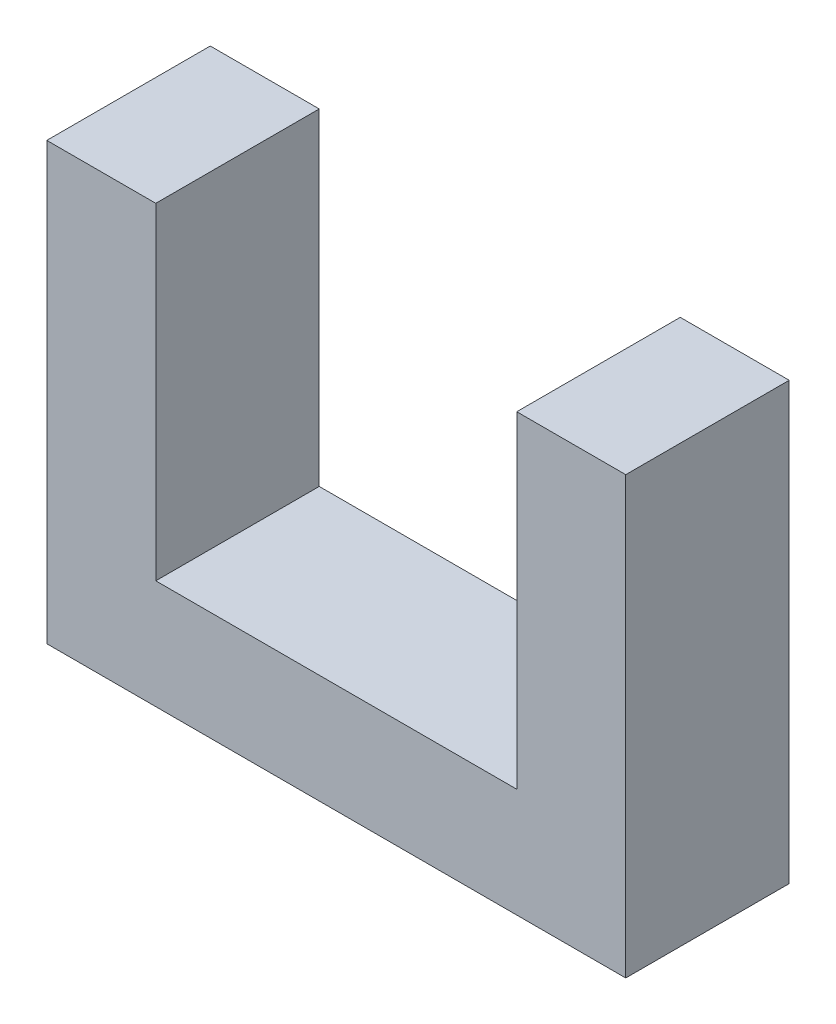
from build123d import *

# Parameters (mm, degrees)
SALIENTE_EXTRUIR1_DEPTH = 12


with BuildPart() as part:
    # Croquis1 → Saliente-Extruir1 (new body)
    with BuildSketch(Plane.XY):
        Polygon((-21.25, 24), (-21.25, -8), (21.25, -8), (21.25, 24), (13.25, 24), (13.25, 0), (-13.25, 0), (-13.25, 24), align=None)
    extrude(amount=SALIENTE_EXTRUIR1_DEPTH)


solid = part.part
